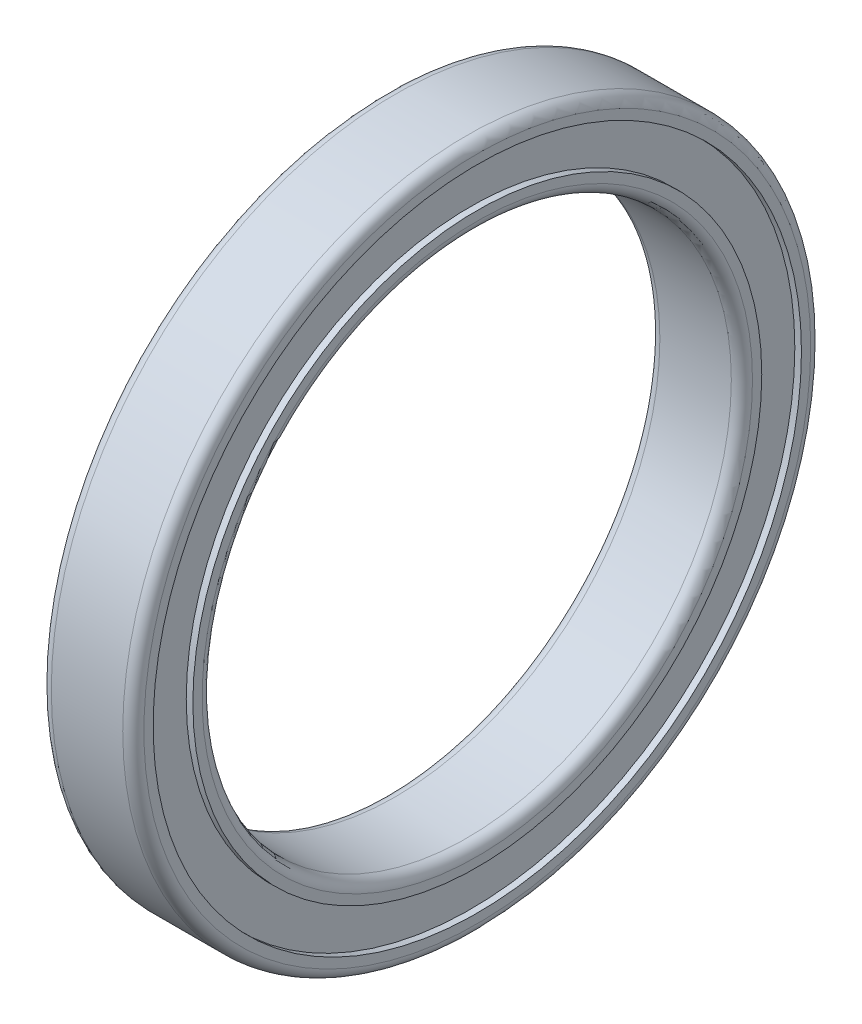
ISO-10303-21;
HEADER;
FILE_DESCRIPTION(('STEP AP214'),'2;1');
FILE_NAME('part.step','',(''),(''),'','','');
FILE_SCHEMA(('AUTOMOTIVE_DESIGN { 1 0 10303 214 1 1 1 1 }'));
ENDSEC;
DATA;
#1=APPLICATION_CONTEXT('core data for automotive mechanical design processes');
#2=APPLICATION_PROTOCOL_DEFINITION('international standard','automotive_design',2000,#1);
#3=PRODUCT_CONTEXT('',#1,'mechanical');
#4=PRODUCT('Part','Part','',(#3));
#5=PRODUCT_RELATED_PRODUCT_CATEGORY('part','',(#4));
#6=PRODUCT_DEFINITION_FORMATION('','',#4);
#7=PRODUCT_DEFINITION_CONTEXT('part definition',#1,'design');
#8=PRODUCT_DEFINITION('design','',#6,#7);
#9=PRODUCT_DEFINITION_SHAPE('','',#8);
#10=(LENGTH_UNIT() NAMED_UNIT(*) SI_UNIT(.MILLI.,.METRE.));
#11=(NAMED_UNIT(*) PLANE_ANGLE_UNIT() SI_UNIT($,.RADIAN.));
#12=(NAMED_UNIT(*) SI_UNIT($,.STERADIAN.) SOLID_ANGLE_UNIT());
#13=UNCERTAINTY_MEASURE_WITH_UNIT(LENGTH_MEASURE(1.E-05),#10,'distance_accuracy_value','');
#14=(GEOMETRIC_REPRESENTATION_CONTEXT(3) GLOBAL_UNCERTAINTY_ASSIGNED_CONTEXT((#13)) GLOBAL_UNIT_ASSIGNED_CONTEXT((#10,
#11,#12)) REPRESENTATION_CONTEXT('',''));
#15=CARTESIAN_POINT('',(0.,0.,0.));
#16=DIRECTION('',(0.,0.,1.));
#17=DIRECTION('',(1.,0.,0.));
#18=AXIS2_PLACEMENT_3D('',#15,#16,#17);
#19=CARTESIAN_POINT('',(-3.5,20.,0.));
#20=DIRECTION('',(-1.,0.,0.));
#21=DIRECTION('',(0.,0.,1.));
#22=AXIS2_PLACEMENT_3D('',#19,#20,#21);
#23=PLANE('',#22);
#24=CARTESIAN_POINT('',(-3.5,0.,0.));
#25=DIRECTION('',(-1.,0.,0.));
#26=DIRECTION('',(0.,0.,1.));
#27=AXIS2_PLACEMENT_3D('',#24,#25,#26);
#28=CIRCLE('',#27,20.8);
#29=CARTESIAN_POINT('',(-3.5,0.,20.8));
#30=VERTEX_POINT('',#29);
#31=EDGE_CURVE('E52',#30,#30,#28,.F.);
#32=ORIENTED_EDGE('',*,*,#31,.T.);
#33=EDGE_LOOP('',(#32));
#34=FACE_BOUND('',#33,.T.);
#35=CARTESIAN_POINT('',(-3.5,0.,0.));
#36=DIRECTION('',(1.,0.,0.));
#37=DIRECTION('',(0.,0.,-1.));
#38=AXIS2_PLACEMENT_3D('',#35,#36,#37);
#39=CIRCLE('',#38,21.5);
#40=CARTESIAN_POINT('',(-3.5,0.,-21.5));
#41=VERTEX_POINT('',#40);
#42=EDGE_CURVE('E90',#41,#41,#39,.T.);
#43=ORIENTED_EDGE('',*,*,#42,.F.);
#44=EDGE_LOOP('',(#43));
#45=FACE_BOUND('',#44,.T.);
#46=ADVANCED_FACE('F37',(#34,#45),#23,.T.);
#47=CARTESIAN_POINT('',(0.,0.,0.));
#48=DIRECTION('',(1.,0.,0.));
#49=DIRECTION('',(0.,0.,-1.));
#50=AXIS2_PLACEMENT_3D('',#47,#48,#49);
#51=CYLINDRICAL_SURFACE('',#50,20.);
#52=CARTESIAN_POINT('',(-2.7,0.,0.));
#53=DIRECTION('',(-1.,0.,0.));
#54=DIRECTION('',(0.,0.,1.));
#55=AXIS2_PLACEMENT_3D('',#52,#53,#54);
#56=CIRCLE('',#55,20.);
#57=CARTESIAN_POINT('',(-2.7,0.,20.));
#58=VERTEX_POINT('',#57);
#59=EDGE_CURVE('E44',#58,#58,#56,.T.);
#60=ORIENTED_EDGE('',*,*,#59,.T.);
#61=EDGE_LOOP('',(#60));
#62=FACE_BOUND('',#61,.T.);
#63=CARTESIAN_POINT('',(2.7,0.,0.));
#64=DIRECTION('',(1.,0.,0.));
#65=DIRECTION('',(0.,0.,-1.));
#66=AXIS2_PLACEMENT_3D('',#63,#64,#65);
#67=CIRCLE('',#66,20.);
#68=CARTESIAN_POINT('',(2.7,0.,-20.));
#69=VERTEX_POINT('',#68);
#70=EDGE_CURVE('E48',#69,#69,#67,.T.);
#71=ORIENTED_EDGE('',*,*,#70,.T.);
#72=EDGE_LOOP('',(#71));
#73=FACE_BOUND('',#72,.T.);
#74=ADVANCED_FACE('F98',(#62,#73),#51,.F.);
#75=CARTESIAN_POINT('',(3.5,20.,0.));
#76=DIRECTION('',(1.,0.,0.));
#77=DIRECTION('',(0.,0.,-1.));
#78=AXIS2_PLACEMENT_3D('',#75,#76,#77);
#79=PLANE('',#78);
#80=CARTESIAN_POINT('',(3.5,0.,0.));
#81=DIRECTION('',(1.,0.,0.));
#82=DIRECTION('',(0.,0.,-1.));
#83=AXIS2_PLACEMENT_3D('',#80,#81,#82);
#84=CIRCLE('',#83,20.8);
#85=CARTESIAN_POINT('',(3.5,0.,-20.8));
#86=VERTEX_POINT('',#85);
#87=EDGE_CURVE('E10',#86,#86,#84,.F.);
#88=ORIENTED_EDGE('',*,*,#87,.T.);
#89=EDGE_LOOP('',(#88));
#90=FACE_BOUND('',#89,.T.);
#91=CARTESIAN_POINT('',(3.5,0.,0.));
#92=DIRECTION('',(1.,0.,0.));
#93=DIRECTION('',(0.,0.,-1.));
#94=AXIS2_PLACEMENT_3D('',#91,#92,#93);
#95=CIRCLE('',#94,21.5);
#96=CARTESIAN_POINT('',(3.5,0.,-21.5));
#97=VERTEX_POINT('',#96);
#98=EDGE_CURVE('E69',#97,#97,#95,.T.);
#99=ORIENTED_EDGE('',*,*,#98,.T.);
#100=EDGE_LOOP('',(#99));
#101=FACE_BOUND('',#100,.T.);
#102=ADVANCED_FACE('F104',(#90,#101),#79,.T.);
#103=CARTESIAN_POINT('',(0.,0.,0.));
#104=DIRECTION('',(1.,0.,0.));
#105=DIRECTION('',(0.,0.,-1.));
#106=AXIS2_PLACEMENT_3D('',#103,#104,#105);
#107=CYLINDRICAL_SURFACE('',#106,21.5);
#108=CARTESIAN_POINT('',(3.,0.,0.));
#109=DIRECTION('',(1.,0.,0.));
#110=DIRECTION('',(0.,0.,-1.));
#111=AXIS2_PLACEMENT_3D('',#108,#109,#110);
#112=CIRCLE('',#111,21.5);
#113=CARTESIAN_POINT('',(3.,0.,-21.5));
#114=VERTEX_POINT('',#113);
#115=EDGE_CURVE('E72',#114,#114,#112,.T.);
#116=ORIENTED_EDGE('',*,*,#115,.T.);
#117=EDGE_LOOP('',(#116));
#118=FACE_BOUND('',#117,.T.);
#119=ORIENTED_EDGE('',*,*,#98,.F.);
#120=EDGE_LOOP('',(#119));
#121=FACE_BOUND('',#120,.T.);
#122=ADVANCED_FACE('F192',(#118,#121),#107,.T.);
#123=CARTESIAN_POINT('',(3.,21.5,0.));
#124=DIRECTION('',(1.,0.,0.));
#125=DIRECTION('',(0.,0.,-1.));
#126=AXIS2_PLACEMENT_3D('',#123,#124,#125);
#127=PLANE('',#126);
#128=CARTESIAN_POINT('',(3.,0.,0.));
#129=DIRECTION('',(1.,0.,0.));
#130=DIRECTION('',(0.,0.,-1.));
#131=AXIS2_PLACEMENT_3D('',#128,#129,#130);
#132=CIRCLE('',#131,24.5);
#133=CARTESIAN_POINT('',(3.,0.,-24.5));
#134=VERTEX_POINT('',#133);
#135=EDGE_CURVE('E75',#134,#134,#132,.T.);
#136=ORIENTED_EDGE('',*,*,#135,.T.);
#137=EDGE_LOOP('',(#136));
#138=FACE_BOUND('',#137,.T.);
#139=ORIENTED_EDGE('',*,*,#115,.F.);
#140=EDGE_LOOP('',(#139));
#141=FACE_BOUND('',#140,.T.);
#142=ADVANCED_FACE('F235',(#138,#141),#127,.T.);
#143=CARTESIAN_POINT('',(0.,0.,0.));
#144=DIRECTION('',(1.,0.,0.));
#145=DIRECTION('',(0.,0.,-1.));
#146=AXIS2_PLACEMENT_3D('',#143,#144,#145);
#147=CYLINDRICAL_SURFACE('',#146,24.5);
#148=CARTESIAN_POINT('',(3.5,0.,0.));
#149=DIRECTION('',(1.,0.,0.));
#150=DIRECTION('',(0.,0.,-1.));
#151=AXIS2_PLACEMENT_3D('',#148,#149,#150);
#152=CIRCLE('',#151,24.5);
#153=CARTESIAN_POINT('',(3.5,0.,-24.5));
#154=VERTEX_POINT('',#153);
#155=EDGE_CURVE('E78',#154,#154,#152,.T.);
#156=ORIENTED_EDGE('',*,*,#155,.T.);
#157=EDGE_LOOP('',(#156));
#158=FACE_BOUND('',#157,.T.);
#159=ORIENTED_EDGE('',*,*,#135,.F.);
#160=EDGE_LOOP('',(#159));
#161=FACE_BOUND('',#160,.T.);
#162=ADVANCED_FACE('F180',(#158,#161),#147,.F.);
#163=CARTESIAN_POINT('',(3.5,24.5,0.));
#164=DIRECTION('',(1.,0.,0.));
#165=DIRECTION('',(0.,0.,-1.));
#166=AXIS2_PLACEMENT_3D('',#163,#164,#165);
#167=PLANE('',#166);
#168=CARTESIAN_POINT('',(3.5,0.,0.));
#169=DIRECTION('',(1.,0.,0.));
#170=DIRECTION('',(0.,0.,-1.));
#171=AXIS2_PLACEMENT_3D('',#168,#169,#170);
#172=CIRCLE('',#171,25.2);
#173=CARTESIAN_POINT('',(3.5,0.,-25.2));
#174=VERTEX_POINT('',#173);
#175=EDGE_CURVE('E66',#174,#174,#172,.T.);
#176=ORIENTED_EDGE('',*,*,#175,.T.);
#177=EDGE_LOOP('',(#176));
#178=FACE_BOUND('',#177,.T.);
#179=ORIENTED_EDGE('',*,*,#155,.F.);
#180=EDGE_LOOP('',(#179));
#181=FACE_BOUND('',#180,.T.);
#182=ADVANCED_FACE('F170',(#178,#181),#167,.T.);
#183=CARTESIAN_POINT('',(0.,0.,0.));
#184=DIRECTION('',(1.,0.,0.));
#185=DIRECTION('',(0.,0.,-1.));
#186=AXIS2_PLACEMENT_3D('',#183,#184,#185);
#187=CYLINDRICAL_SURFACE('',#186,26.);
#188=CARTESIAN_POINT('',(2.7,0.,0.));
#189=DIRECTION('',(1.,0.,0.));
#190=DIRECTION('',(0.,0.,-1.));
#191=AXIS2_PLACEMENT_3D('',#188,#189,#190);
#192=CIRCLE('',#191,26.);
#193=CARTESIAN_POINT('',(2.7,0.,-26.));
#194=VERTEX_POINT('',#193);
#195=EDGE_CURVE('E60',#194,#194,#192,.F.);
#196=ORIENTED_EDGE('',*,*,#195,.T.);
#197=EDGE_LOOP('',(#196));
#198=FACE_BOUND('',#197,.T.);
#199=CARTESIAN_POINT('',(-2.7,0.,0.));
#200=DIRECTION('',(-1.,0.,0.));
#201=DIRECTION('',(0.,0.,1.));
#202=AXIS2_PLACEMENT_3D('',#199,#200,#201);
#203=CIRCLE('',#202,26.);
#204=CARTESIAN_POINT('',(-2.7,0.,26.));
#205=VERTEX_POINT('',#204);
#206=EDGE_CURVE('E63',#205,#205,#203,.F.);
#207=ORIENTED_EDGE('',*,*,#206,.T.);
#208=EDGE_LOOP('',(#207));
#209=FACE_BOUND('',#208,.T.);
#210=ADVANCED_FACE('F158',(#198,#209),#187,.T.);
#211=CARTESIAN_POINT('',(-3.5,24.5,0.));
#212=DIRECTION('',(-1.,0.,0.));
#213=DIRECTION('',(0.,0.,1.));
#214=AXIS2_PLACEMENT_3D('',#211,#212,#213);
#215=PLANE('',#214);
#216=CARTESIAN_POINT('',(-3.5,0.,0.));
#217=DIRECTION('',(-1.,0.,0.));
#218=DIRECTION('',(0.,0.,1.));
#219=AXIS2_PLACEMENT_3D('',#216,#217,#218);
#220=CIRCLE('',#219,25.2);
#221=CARTESIAN_POINT('',(-3.5,0.,25.2));
#222=VERTEX_POINT('',#221);
#223=EDGE_CURVE('E57',#222,#222,#220,.T.);
#224=ORIENTED_EDGE('',*,*,#223,.T.);
#225=EDGE_LOOP('',(#224));
#226=FACE_BOUND('',#225,.T.);
#227=CARTESIAN_POINT('',(-3.5,0.,0.));
#228=DIRECTION('',(1.,0.,0.));
#229=DIRECTION('',(0.,0.,-1.));
#230=AXIS2_PLACEMENT_3D('',#227,#228,#229);
#231=CIRCLE('',#230,24.5);
#232=CARTESIAN_POINT('',(-3.5,0.,-24.5));
#233=VERTEX_POINT('',#232);
#234=EDGE_CURVE('E81',#233,#233,#231,.T.);
#235=ORIENTED_EDGE('',*,*,#234,.T.);
#236=EDGE_LOOP('',(#235));
#237=FACE_BOUND('',#236,.T.);
#238=ADVANCED_FACE('F152',(#226,#237),#215,.T.);
#239=CARTESIAN_POINT('',(0.,0.,0.));
#240=DIRECTION('',(1.,0.,0.));
#241=DIRECTION('',(0.,0.,-1.));
#242=AXIS2_PLACEMENT_3D('',#239,#240,#241);
#243=CYLINDRICAL_SURFACE('',#242,24.5);
#244=CARTESIAN_POINT('',(-3.,0.,0.));
#245=DIRECTION('',(1.,0.,0.));
#246=DIRECTION('',(0.,0.,-1.));
#247=AXIS2_PLACEMENT_3D('',#244,#245,#246);
#248=CIRCLE('',#247,24.5);
#249=CARTESIAN_POINT('',(-3.,0.,-24.5));
#250=VERTEX_POINT('',#249);
#251=EDGE_CURVE('E84',#250,#250,#248,.T.);
#252=ORIENTED_EDGE('',*,*,#251,.T.);
#253=EDGE_LOOP('',(#252));
#254=FACE_BOUND('',#253,.T.);
#255=ORIENTED_EDGE('',*,*,#234,.F.);
#256=EDGE_LOOP('',(#255));
#257=FACE_BOUND('',#256,.T.);
#258=ADVANCED_FACE('F157',(#254,#257),#243,.F.);
#259=CARTESIAN_POINT('',(-3.,21.5,0.));
#260=DIRECTION('',(-1.,0.,0.));
#261=DIRECTION('',(0.,0.,1.));
#262=AXIS2_PLACEMENT_3D('',#259,#260,#261);
#263=PLANE('',#262);
#264=CARTESIAN_POINT('',(-3.,0.,0.));
#265=DIRECTION('',(1.,0.,0.));
#266=DIRECTION('',(0.,0.,-1.));
#267=AXIS2_PLACEMENT_3D('',#264,#265,#266);
#268=CIRCLE('',#267,21.5);
#269=CARTESIAN_POINT('',(-3.,0.,-21.5));
#270=VERTEX_POINT('',#269);
#271=EDGE_CURVE('E87',#270,#270,#268,.T.);
#272=ORIENTED_EDGE('',*,*,#271,.T.);
#273=EDGE_LOOP('',(#272));
#274=FACE_BOUND('',#273,.T.);
#275=ORIENTED_EDGE('',*,*,#251,.F.);
#276=EDGE_LOOP('',(#275));
#277=FACE_BOUND('',#276,.T.);
#278=ADVANCED_FACE('F210',(#274,#277),#263,.T.);
#279=CARTESIAN_POINT('',(0.,0.,0.));
#280=DIRECTION('',(1.,0.,0.));
#281=DIRECTION('',(0.,0.,-1.));
#282=AXIS2_PLACEMENT_3D('',#279,#280,#281);
#283=CYLINDRICAL_SURFACE('',#282,21.5);
#284=ORIENTED_EDGE('',*,*,#42,.T.);
#285=EDGE_LOOP('',(#284));
#286=FACE_BOUND('',#285,.T.);
#287=ORIENTED_EDGE('',*,*,#271,.F.);
#288=EDGE_LOOP('',(#287));
#289=FACE_BOUND('',#288,.T.);
#290=ADVANCED_FACE('F94',(#286,#289),#283,.T.);
#291=CARTESIAN_POINT('',(2.7,0.,0.));
#292=DIRECTION('',(1.,0.,0.));
#293=DIRECTION('',(0.,0.,-1.));
#294=AXIS2_PLACEMENT_3D('',#291,#292,#293);
#295=TOROIDAL_SURFACE('',#294,25.2,0.8);
#296=ORIENTED_EDGE('',*,*,#195,.F.);
#297=EDGE_LOOP('',(#296));
#298=FACE_BOUND('',#297,.T.);
#299=ORIENTED_EDGE('',*,*,#175,.F.);
#300=EDGE_LOOP('',(#299));
#301=FACE_BOUND('',#300,.T.);
#302=ADVANCED_FACE('F108',(#298,#301),#295,.T.);
#303=CARTESIAN_POINT('',(-2.7,0.,0.));
#304=DIRECTION('',(-1.,0.,0.));
#305=DIRECTION('',(0.,0.,1.));
#306=AXIS2_PLACEMENT_3D('',#303,#304,#305);
#307=TOROIDAL_SURFACE('',#306,25.2,0.8);
#308=ORIENTED_EDGE('',*,*,#223,.F.);
#309=EDGE_LOOP('',(#308));
#310=FACE_BOUND('',#309,.T.);
#311=ORIENTED_EDGE('',*,*,#206,.F.);
#312=EDGE_LOOP('',(#311));
#313=FACE_BOUND('',#312,.T.);
#314=ADVANCED_FACE('F111',(#310,#313),#307,.T.);
#315=CARTESIAN_POINT('',(-2.7,0.,0.));
#316=DIRECTION('',(-1.,0.,0.));
#317=DIRECTION('',(0.,0.,1.));
#318=AXIS2_PLACEMENT_3D('',#315,#316,#317);
#319=TOROIDAL_SURFACE('',#318,20.8,0.8);
#320=ORIENTED_EDGE('',*,*,#59,.F.);
#321=EDGE_LOOP('',(#320));
#322=FACE_BOUND('',#321,.T.);
#323=ORIENTED_EDGE('',*,*,#31,.F.);
#324=EDGE_LOOP('',(#323));
#325=FACE_BOUND('',#324,.T.);
#326=ADVANCED_FACE('F114',(#322,#325),#319,.T.);
#327=CARTESIAN_POINT('',(2.7,0.,0.));
#328=DIRECTION('',(1.,0.,0.));
#329=DIRECTION('',(0.,0.,-1.));
#330=AXIS2_PLACEMENT_3D('',#327,#328,#329);
#331=TOROIDAL_SURFACE('',#330,20.8,0.8);
#332=ORIENTED_EDGE('',*,*,#87,.F.);
#333=EDGE_LOOP('',(#332));
#334=FACE_BOUND('',#333,.T.);
#335=ORIENTED_EDGE('',*,*,#70,.F.);
#336=EDGE_LOOP('',(#335));
#337=FACE_BOUND('',#336,.T.);
#338=ADVANCED_FACE('F39',(#334,#337),#331,.T.);
#339=CLOSED_SHELL('',(#46,#74,#102,#122,#142,#162,#182,#210,#238,#258,#278,#290,#302,#314,#326,#338));
#340=MANIFOLD_SOLID_BREP('B2',#339);
#341=ADVANCED_BREP_SHAPE_REPRESENTATION('',(#18,#340),#14);
#342=SHAPE_DEFINITION_REPRESENTATION(#9,#341);
ENDSEC;
END-ISO-10303-21;
